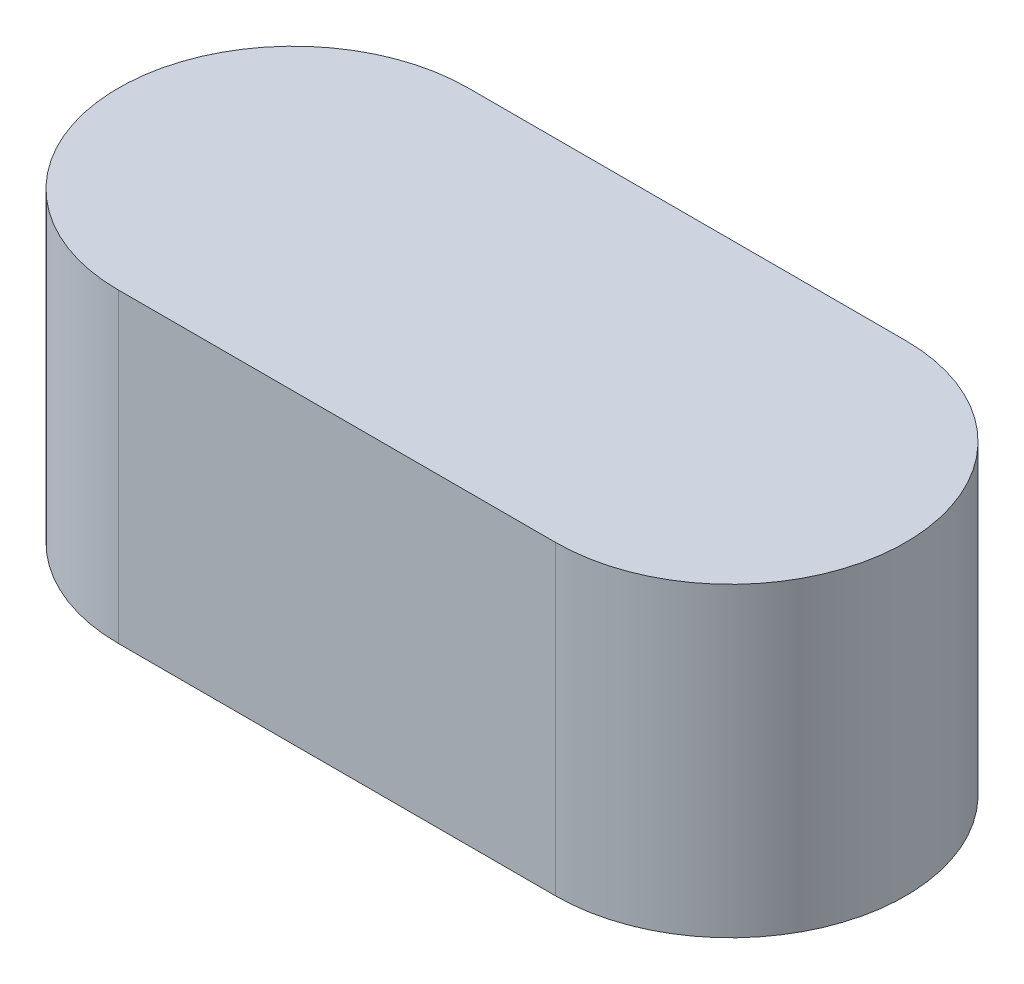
ISO-10303-21;
HEADER;
FILE_DESCRIPTION(('STEP AP214'),'2;1');
FILE_NAME('part.step','',(''),(''),'','','');
FILE_SCHEMA(('AUTOMOTIVE_DESIGN { 1 0 10303 214 1 1 1 1 }'));
ENDSEC;
DATA;
#1=APPLICATION_CONTEXT('core data for automotive mechanical design processes');
#2=APPLICATION_PROTOCOL_DEFINITION('international standard','automotive_design',2000,#1);
#3=PRODUCT_CONTEXT('',#1,'mechanical');
#4=PRODUCT('Part','Part','',(#3));
#5=PRODUCT_RELATED_PRODUCT_CATEGORY('part','',(#4));
#6=PRODUCT_DEFINITION_FORMATION('','',#4);
#7=PRODUCT_DEFINITION_CONTEXT('part definition',#1,'design');
#8=PRODUCT_DEFINITION('design','',#6,#7);
#9=PRODUCT_DEFINITION_SHAPE('','',#8);
#10=(LENGTH_UNIT() NAMED_UNIT(*) SI_UNIT(.MILLI.,.METRE.));
#11=(NAMED_UNIT(*) PLANE_ANGLE_UNIT() SI_UNIT($,.RADIAN.));
#12=(NAMED_UNIT(*) SI_UNIT($,.STERADIAN.) SOLID_ANGLE_UNIT());
#13=UNCERTAINTY_MEASURE_WITH_UNIT(LENGTH_MEASURE(1.E-05),#10,'distance_accuracy_value','');
#14=(GEOMETRIC_REPRESENTATION_CONTEXT(3) GLOBAL_UNCERTAINTY_ASSIGNED_CONTEXT((#13)) GLOBAL_UNIT_ASSIGNED_CONTEXT((#10,
#11,#12)) REPRESENTATION_CONTEXT('',''));
#15=CARTESIAN_POINT('',(0.,0.,0.));
#16=DIRECTION('',(0.,0.,1.));
#17=DIRECTION('',(1.,0.,0.));
#18=AXIS2_PLACEMENT_3D('',#15,#16,#17);
#19=CARTESIAN_POINT('',(-10.,-7.,0.));
#20=DIRECTION('',(0.,1.,0.));
#21=DIRECTION('',(-1.,0.,0.));
#22=AXIS2_PLACEMENT_3D('',#19,#20,#21);
#23=CYLINDRICAL_SURFACE('',#22,4.);
#24=CARTESIAN_POINT('',(-10.,0.,0.));
#25=DIRECTION('',(0.,-1.,0.));
#26=DIRECTION('',(1.,0.,0.));
#27=AXIS2_PLACEMENT_3D('',#24,#25,#26);
#28=CIRCLE('',#27,4.);
#29=CARTESIAN_POINT('',(-10.,0.,4.));
#30=VERTEX_POINT('',#29);
#31=CARTESIAN_POINT('',(-10.,0.,-4.));
#32=VERTEX_POINT('',#31);
#33=EDGE_CURVE('E70',#30,#32,#28,.T.);
#34=ORIENTED_EDGE('',*,*,#33,.T.);
#35=DIRECTION('',(0.,1.,0.));
#36=VECTOR('',#35,1.);
#37=CARTESIAN_POINT('',(-10.,-7.,-4.));
#38=LINE('',#37,#36);
#39=CARTESIAN_POINT('',(-10.,-7.,-4.));
#40=VERTEX_POINT('',#39);
#41=EDGE_CURVE('E11',#40,#32,#38,.T.);
#42=ORIENTED_EDGE('',*,*,#41,.F.);
#43=CARTESIAN_POINT('',(-10.,-7.,0.));
#44=DIRECTION('',(0.,-1.,0.));
#45=DIRECTION('',(1.,0.,0.));
#46=AXIS2_PLACEMENT_3D('',#43,#44,#45);
#47=CIRCLE('',#46,4.);
#48=CARTESIAN_POINT('',(-10.,-7.,4.));
#49=VERTEX_POINT('',#48);
#50=EDGE_CURVE('E88',#49,#40,#47,.T.);
#51=ORIENTED_EDGE('',*,*,#50,.F.);
#52=DIRECTION('',(0.,1.,0.));
#53=VECTOR('',#52,1.);
#54=CARTESIAN_POINT('',(-10.,-7.,4.));
#55=LINE('',#54,#53);
#56=EDGE_CURVE('E82',#49,#30,#55,.T.);
#57=ORIENTED_EDGE('',*,*,#56,.T.);
#58=EDGE_LOOP('',(#34,#42,#51,#57));
#59=FACE_BOUND('',#58,.T.);
#60=ADVANCED_FACE('F26',(#59),#23,.T.);
#61=CARTESIAN_POINT('',(0.,-7.,-4.));
#62=DIRECTION('',(0.,0.,1.));
#63=DIRECTION('',(1.,0.,0.));
#64=AXIS2_PLACEMENT_3D('',#61,#62,#63);
#65=PLANE('',#64);
#66=DIRECTION('',(1.,0.,0.));
#67=VECTOR('',#66,1.);
#68=CARTESIAN_POINT('',(0.,0.,-4.));
#69=LINE('',#68,#67);
#70=CARTESIAN_POINT('',(0.,0.,-4.));
#71=VERTEX_POINT('',#70);
#72=EDGE_CURVE('E66',#32,#71,#69,.T.);
#73=ORIENTED_EDGE('',*,*,#72,.T.);
#74=DIRECTION('',(0.,1.,0.));
#75=VECTOR('',#74,1.);
#76=CARTESIAN_POINT('',(0.,-7.,-4.));
#77=LINE('',#76,#75);
#78=CARTESIAN_POINT('',(0.,-7.,-4.));
#79=VERTEX_POINT('',#78);
#80=EDGE_CURVE('E33',#79,#71,#77,.T.);
#81=ORIENTED_EDGE('',*,*,#80,.F.);
#82=DIRECTION('',(1.,0.,0.));
#83=VECTOR('',#82,1.);
#84=CARTESIAN_POINT('',(0.,-7.,-4.));
#85=LINE('',#84,#83);
#86=EDGE_CURVE('E78',#40,#79,#85,.T.);
#87=ORIENTED_EDGE('',*,*,#86,.F.);
#88=ORIENTED_EDGE('',*,*,#41,.T.);
#89=EDGE_LOOP('',(#73,#81,#87,#88));
#90=FACE_BOUND('',#89,.T.);
#91=ADVANCED_FACE('F77',(#90),#65,.F.);
#92=CARTESIAN_POINT('',(0.,-7.,0.));
#93=DIRECTION('',(0.,1.,0.));
#94=DIRECTION('',(-1.,0.,0.));
#95=AXIS2_PLACEMENT_3D('',#92,#93,#94);
#96=CYLINDRICAL_SURFACE('',#95,4.);
#97=CARTESIAN_POINT('',(0.,0.,0.));
#98=DIRECTION('',(0.,-1.,0.));
#99=DIRECTION('',(1.,0.,0.));
#100=AXIS2_PLACEMENT_3D('',#97,#98,#99);
#101=CIRCLE('',#100,4.);
#102=CARTESIAN_POINT('',(0.,0.,4.));
#103=VERTEX_POINT('',#102);
#104=EDGE_CURVE('E71',#71,#103,#101,.T.);
#105=ORIENTED_EDGE('',*,*,#104,.T.);
#106=DIRECTION('',(0.,1.,0.));
#107=VECTOR('',#106,1.);
#108=CARTESIAN_POINT('',(0.,-7.,4.));
#109=LINE('',#108,#107);
#110=CARTESIAN_POINT('',(0.,-7.,4.));
#111=VERTEX_POINT('',#110);
#112=EDGE_CURVE('E94',#111,#103,#109,.T.);
#113=ORIENTED_EDGE('',*,*,#112,.F.);
#114=CARTESIAN_POINT('',(0.,-7.,0.));
#115=DIRECTION('',(0.,-1.,0.));
#116=DIRECTION('',(1.,0.,0.));
#117=AXIS2_PLACEMENT_3D('',#114,#115,#116);
#118=CIRCLE('',#117,4.);
#119=EDGE_CURVE('E45',#79,#111,#118,.T.);
#120=ORIENTED_EDGE('',*,*,#119,.F.);
#121=ORIENTED_EDGE('',*,*,#80,.T.);
#122=EDGE_LOOP('',(#105,#113,#120,#121));
#123=FACE_BOUND('',#122,.T.);
#124=ADVANCED_FACE('F97',(#123),#96,.T.);
#125=CARTESIAN_POINT('',(0.,-7.,4.));
#126=DIRECTION('',(0.,0.,-1.));
#127=DIRECTION('',(-1.,0.,0.));
#128=AXIS2_PLACEMENT_3D('',#125,#126,#127);
#129=PLANE('',#128);
#130=DIRECTION('',(-1.,0.,0.));
#131=VECTOR('',#130,1.);
#132=CARTESIAN_POINT('',(0.,0.,4.));
#133=LINE('',#132,#131);
#134=EDGE_CURVE('E86',#103,#30,#133,.T.);
#135=ORIENTED_EDGE('',*,*,#134,.T.);
#136=ORIENTED_EDGE('',*,*,#56,.F.);
#137=DIRECTION('',(-1.,0.,0.));
#138=VECTOR('',#137,1.);
#139=CARTESIAN_POINT('',(0.,-7.,4.));
#140=LINE('',#139,#138);
#141=EDGE_CURVE('E40',#111,#49,#140,.T.);
#142=ORIENTED_EDGE('',*,*,#141,.F.);
#143=ORIENTED_EDGE('',*,*,#112,.T.);
#144=EDGE_LOOP('',(#135,#136,#142,#143));
#145=FACE_BOUND('',#144,.T.);
#146=ADVANCED_FACE('F99',(#145),#129,.F.);
#147=CARTESIAN_POINT('',(-10.,-7.,0.));
#148=DIRECTION('',(0.,-1.,0.));
#149=DIRECTION('',(1.,0.,0.));
#150=AXIS2_PLACEMENT_3D('',#147,#148,#149);
#151=PLANE('',#150);
#152=ORIENTED_EDGE('',*,*,#50,.T.);
#153=ORIENTED_EDGE('',*,*,#86,.T.);
#154=ORIENTED_EDGE('',*,*,#119,.T.);
#155=ORIENTED_EDGE('',*,*,#141,.T.);
#156=EDGE_LOOP('',(#152,#153,#154,#155));
#157=FACE_BOUND('',#156,.T.);
#158=ADVANCED_FACE('F100',(#157),#151,.T.);
#159=CARTESIAN_POINT('',(-10.,0.,0.));
#160=DIRECTION('',(0.,-1.,0.));
#161=DIRECTION('',(1.,0.,0.));
#162=AXIS2_PLACEMENT_3D('',#159,#160,#161);
#163=PLANE('',#162);
#164=ORIENTED_EDGE('',*,*,#33,.F.);
#165=ORIENTED_EDGE('',*,*,#134,.F.);
#166=ORIENTED_EDGE('',*,*,#104,.F.);
#167=ORIENTED_EDGE('',*,*,#72,.F.);
#168=EDGE_LOOP('',(#164,#165,#166,#167));
#169=FACE_BOUND('',#168,.T.);
#170=ADVANCED_FACE('F67',(#169),#163,.F.);
#171=CLOSED_SHELL('',(#60,#91,#124,#146,#158,#170));
#172=MANIFOLD_SOLID_BREP('B2',#171);
#173=ADVANCED_BREP_SHAPE_REPRESENTATION('',(#18,#172),#14);
#174=SHAPE_DEFINITION_REPRESENTATION(#9,#173);
ENDSEC;
END-ISO-10303-21;
